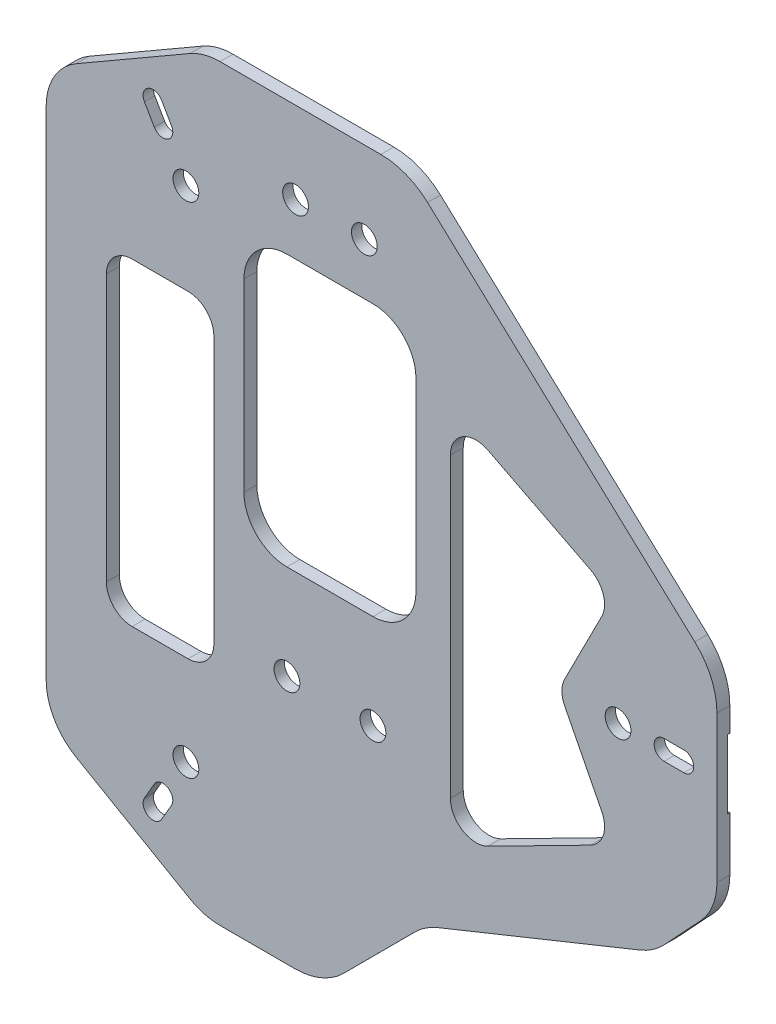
from build123d import *

# Parameters (mm, degrees)
BOSS_EXTRUDE1_DEPTH                     = 0.75
BOSS_EXTRUDE1_DEPTH_BACK                = 0.75
CORNER_RADIUS_7_R                       = 7
CORNER_RADIUS_8_R                       = 8
ALIGN_AXIS_REMAGE_ANGLE                 = 180
GROOVES_DEPTH                           = 0.3
COPPERROD_HOLES_REACH                   = 64.606
SKETCH6_R                               = 1.5
CIRPATTERN1_COUNT                       = 3
CUT_OUTS_REACH                          = 64.606
SKETCH7_W                               = 12.5
SKETCH7_H                               = 37
SKETCH7_W_2                             = 20
SKETCH7_H_2                             = 31.5
CORNER_CUTOUTS_3_R                      = 3
CORNER_CUTOUTS_5_R                      = 5
CBORE_FOR_M5_HEX_HEAD_BOLT1_D           = 3
CBORE_FOR_M5_HEX_HEAD_BOLT1_CBORE_D     = 4.5
CBORE_FOR_M5_HEX_HEAD_BOLT1_CBORE_DEPTH = 0.3


with BuildPart() as part:
    # Sketch3 → Boss-Extrude1 (new, two sides: drawn at the far end of the back side and taken through both)
    with BuildSketch(Plane.XY.offset(-BOSS_EXTRUDE1_DEPTH_BACK)):
        Polygon((-33, 0), (-33, 32.91), (-14.657581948, 43.5), (-0.777581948, 43.5), (11.04795908, 31.651617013), (37.661697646, 20.909228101), (45, 13.039862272), (45, -10.290137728), (9.052418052, -43.5), (-14.657581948, -43.5), (-33, -32.91), align=None)
    extrude(amount=BOSS_EXTRUDE1_DEPTH + BOSS_EXTRUDE1_DEPTH_BACK)

    # Corner_Radius_7
    corner_radius_7_edges = [part.edges().sort_by_distance(p)[0] for p in [
        (-33, 32.91, 0),
        (-14.657581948, 43.5, 0),
        (45, 13.039862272, 0),
        (-14.657581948, -43.5, 0),
        (-33, -32.91, 0),
    ]]
    fillet(corner_radius_7_edges, radius=CORNER_RADIUS_7_R)

    # Corner_Radius_8
    corner_radius_8_edges = [part.edges().sort_by_distance(p)[0] for p in [
        (-0.777581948, 43.5, 0),
        (11.04795908, 31.651617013, 0),
        (37.661697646, 20.909228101, 0),
        (45, -10.290137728, 0),
        (9.052418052, -43.5, 0),
    ]]
    fillet(corner_radius_8_edges, radius=CORNER_RADIUS_8_R)


with BuildPart() as part_1:
    # Align_axis_remage: moved
    add(part.part.rotate(Axis((0, 0, 0), (1, 0, 0)), ALIGN_AXIS_REMAGE_ANGLE))

    # Sketch5 → Grooves (cut)
    with BuildSketch(Plane.XY.offset(-0.75)):
        with BuildLine():
            Line((45, 0), (33.5, 0))
            ThreePointArc((33.5, 0), (33.440030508, -2.003586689), (33.260336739, -4))
            Line((33.260336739, -4), (45, -4))
            Line((45, -4), (45, 0))
        make_face()
        with BuildLine():
            ThreePointArc((33.260336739, 4), (33.440030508, 2.003586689), (33.5, 0))
            Line((33.5, 0), (45, 0))
            Line((45, 0), (45, 4))
            Line((45, 4), (33.260336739, 4))
        make_face()
        with BuildLine():
            Line((33.5, 0), (30, 0))
            Line((30, 0), (30, -2.5))
            ThreePointArc((30, -2.5), (30.439339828, -3.560660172), (31.5, -4))
            Line((31.5, -4), (33.260336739, -4))
            ThreePointArc((33.260336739, -4), (33.440030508, -2.003586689), (33.5, 0))
        make_face()
        with BuildLine():
            Line((30, 2.5), (30, 0))
            Line((30, 0), (33.5, 0))
            ThreePointArc((33.5, 0), (33.440030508, 2.003586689), (33.260336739, 4))
            Line((33.260336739, 4), (31.5, 4))
            ThreePointArc((31.5, 4), (30.439339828, 3.560660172), (30, 2.5))
        make_face()
    grooves = extrude(amount=GROOVES_DEPTH, mode=Mode.SUBTRACT)

    # Sketch6 → CopperRod_Holes (cut, up to next)
    with BuildSketch(Plane.XY.offset(0.75), mode=Mode.PRIVATE) as copperrod_holes_sk1:
        with Locations((33.5, 0)):
            Circle(SKETCH6_R)
    copperrod_holes_tool1 = extrude(copperrod_holes_sk1.sketch, amount=-COPPERROD_HOLES_REACH, mode=Mode.PRIVATE) & part_1.part
    # Sketch6 → CopperRod_Holes (cut, up to next)
    with BuildSketch(Plane.XY.offset(0.75), mode=Mode.PRIVATE) as copperrod_holes_sk2:
        with BuildLine():
            Line((38.85, -1.15), (41.15, -1.15))
            ThreePointArc((41.15, -1.15), (42.3, 0), (41.15, 1.15))
            Line((41.15, 1.15), (38.85, 1.15))
            ThreePointArc((38.85, 1.15), (37.7, 0), (38.85, -1.15))
        make_face()
    copperrod_holes_tool2 = extrude(copperrod_holes_sk2.sketch, amount=-COPPERROD_HOLES_REACH, mode=Mode.PRIVATE) & part_1.part
    copperrod_holes_1 = copperrod_holes_tool1.solids().sort_by_distance((33.5, 0, 0.75))[0]
    add(copperrod_holes_1, mode=Mode.SUBTRACT)
    copperrod_holes_2 = copperrod_holes_tool2.solids().sort_by_distance((40, 0, 0.75))[0]
    add(copperrod_holes_2, mode=Mode.SUBTRACT)
    copperrod_holes = copperrod_holes_1 + copperrod_holes_2  # CopperRod_Holes as one shape, for the pattern or mirror that repeats it

    # CirPattern1: Grooves, CopperRod_Holes ×3 about axis
    cirpattern1_axis = Axis((0, 0, 0), (0, 0, 1))
    add([grooves.rotate(cirpattern1_axis, i * 360 / CIRPATTERN1_COUNT) for i in range(1, CIRPATTERN1_COUNT)], mode=Mode.SUBTRACT)
    add([copperrod_holes.rotate(cirpattern1_axis, i * 360 / CIRPATTERN1_COUNT) for i in range(1, CIRPATTERN1_COUNT)], mode=Mode.SUBTRACT)

    # Sketch7 → Cut-Outs (cut, up to next)
    with BuildSketch(Plane.XY.offset(0.75), mode=Mode.PRIVATE) as cut_outs_sk1:
        with Locations((-19.75, 0)):
            Rectangle(SKETCH7_W, SKETCH7_H)
    cut_outs_tool1 = extrude(cut_outs_sk1.sketch, amount=-CUT_OUTS_REACH, mode=Mode.PRIVATE) & part_1.part
    # Sketch7 → Cut-Outs (cut, up to next)
    with BuildSketch(Plane.XY.offset(0.75), mode=Mode.PRIVATE) as cut_outs_sk2:
        Polygon((14, 22.17), (14, -22.17), (32.9695289, -12.504542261), (26.607349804, 0), (32.9695289, 12.504542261), align=None)
    cut_outs_tool2 = extrude(cut_outs_sk2.sketch, amount=-CUT_OUTS_REACH, mode=Mode.PRIVATE) & part_1.part
    # Sketch7 → Cut-Outs (cut, up to next)
    with BuildSketch(Plane.XY.offset(0.75), mode=Mode.PRIVATE) as cut_outs_sk3:
        with Locations((0, 12.25)):
            Rectangle(SKETCH7_W_2, SKETCH7_H_2)
    cut_outs_tool3 = extrude(cut_outs_sk3.sketch, amount=-CUT_OUTS_REACH, mode=Mode.PRIVATE) & part_1.part
    add(cut_outs_tool1.solids().sort_by_distance((-19.75, 0, 0.75))[0], mode=Mode.SUBTRACT)
    add(cut_outs_tool2.solids().sort_by_distance((21.468988, 0, 0.75))[0], mode=Mode.SUBTRACT)
    add(cut_outs_tool3.solids().sort_by_distance((0, 12.25, 0.75))[0], mode=Mode.SUBTRACT)

    # Corner_CutOuts_3
    corner_cutouts_3_edges = [part_1.edges().sort_by_distance(p)[0] for p in [
        (-13.5, -18.5, 0),
        (-26, -18.5, 0),
        (-26, 18.5, 0),
        (-13.5, 18.5, 0),
        (14, 22.17, 0),
        (32.9695289, 12.504542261, 0),
        (26.607349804, 0, 0),
        (32.9695289, -12.504542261, 0),
        (14, -22.17, 0),
    ]]
    fillet(corner_cutouts_3_edges, radius=CORNER_CUTOUTS_3_R)

    # Corner_CutOuts_5
    corner_cutouts_5_edges = [part_1.edges().sort_by_distance(p)[0] for p in [
        (-10, 28, 0),
        (10, 28, 0),
        (10, -3.5, 0),
        (-10, -3.5, 0),
    ]]
    fillet(corner_cutouts_5_edges, radius=CORNER_CUTOUTS_5_R)

    # CBORE for M5 Hex Head Bolt1 (through all)
    with Locations(Plane(origin=(5, -14.5, -0.75), x_dir=(0, -1, 0), z_dir=(0, 0, -1))):
        with Locations((0, 0), (0, 10), (-48.5, 1), (-48.5, 9)):
            CounterBoreHole(CBORE_FOR_M5_HEX_HEAD_BOLT1_D / 2, CBORE_FOR_M5_HEX_HEAD_BOLT1_CBORE_D / 2, CBORE_FOR_M5_HEX_HEAD_BOLT1_CBORE_DEPTH)


solid = part_1.part
